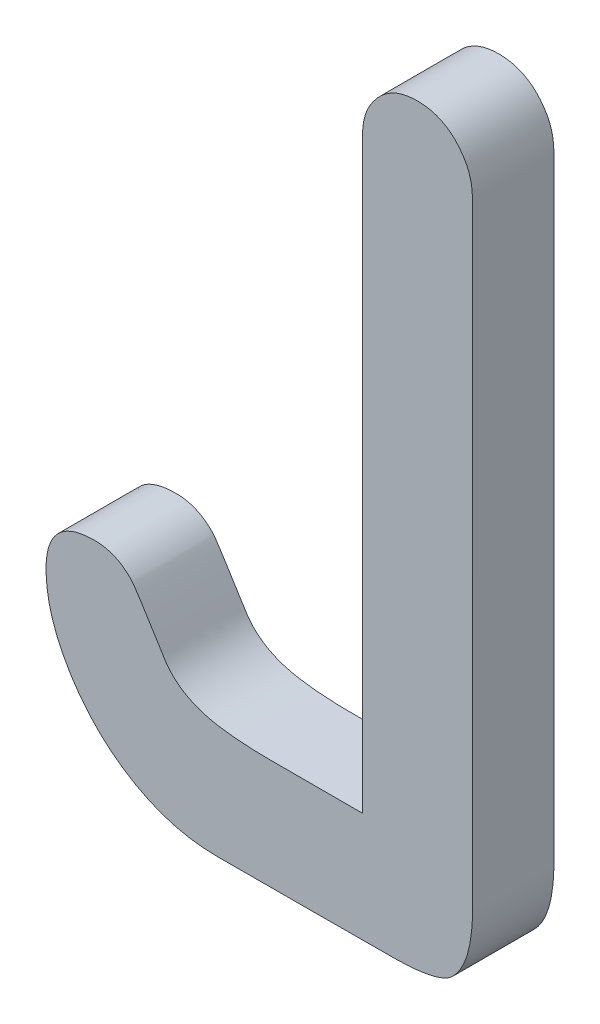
ISO-10303-21;
HEADER;
FILE_DESCRIPTION(('STEP AP214'),'2;1');
FILE_NAME('part.step','',(''),(''),'','','');
FILE_SCHEMA(('AUTOMOTIVE_DESIGN { 1 0 10303 214 1 1 1 1 }'));
ENDSEC;
DATA;
#1=APPLICATION_CONTEXT('core data for automotive mechanical design processes');
#2=APPLICATION_PROTOCOL_DEFINITION('international standard','automotive_design',2000,#1);
#3=PRODUCT_CONTEXT('',#1,'mechanical');
#4=PRODUCT('Part','Part','',(#3));
#5=PRODUCT_RELATED_PRODUCT_CATEGORY('part','',(#4));
#6=PRODUCT_DEFINITION_FORMATION('','',#4);
#7=PRODUCT_DEFINITION_CONTEXT('part definition',#1,'design');
#8=PRODUCT_DEFINITION('design','',#6,#7);
#9=PRODUCT_DEFINITION_SHAPE('','',#8);
#10=(LENGTH_UNIT() NAMED_UNIT(*) SI_UNIT(.MILLI.,.METRE.));
#11=(NAMED_UNIT(*) PLANE_ANGLE_UNIT() SI_UNIT($,.RADIAN.));
#12=(NAMED_UNIT(*) SI_UNIT($,.STERADIAN.) SOLID_ANGLE_UNIT());
#13=UNCERTAINTY_MEASURE_WITH_UNIT(LENGTH_MEASURE(1.E-05),#10,'distance_accuracy_value','');
#14=(GEOMETRIC_REPRESENTATION_CONTEXT(3) GLOBAL_UNCERTAINTY_ASSIGNED_CONTEXT((#13)) GLOBAL_UNIT_ASSIGNED_CONTEXT((#10,
#11,#12)) REPRESENTATION_CONTEXT('',''));
#15=CARTESIAN_POINT('',(0.,0.,0.));
#16=DIRECTION('',(0.,0.,1.));
#17=DIRECTION('',(1.,0.,0.));
#18=AXIS2_PLACEMENT_3D('',#15,#16,#17);
#19=CARTESIAN_POINT('',(32.8734988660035,-0.0550507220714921,0.500000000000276));
#20=CARTESIAN_POINT('',(32.8734988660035,1.74256832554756,0.500000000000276));
#21=CARTESIAN_POINT('',(32.8734988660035,3.54018737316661,0.500000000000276));
#22=CARTESIAN_POINT('',(32.8734988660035,3.65447308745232,0.500000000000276));
#23=CARTESIAN_POINT('',(32.9194963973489,3.73163023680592,0.500000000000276));
#24=CARTESIAN_POINT('',(33.0211179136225,3.90209213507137,0.500000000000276));
#25=CARTESIAN_POINT('',(33.2115941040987,3.90209213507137,0.500000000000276));
#26=CARTESIAN_POINT('',(33.4020702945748,3.90209213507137,0.500000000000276));
#27=CARTESIAN_POINT('',(33.5036918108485,3.73163023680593,0.500000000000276));
#28=CARTESIAN_POINT('',(33.549689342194,3.65447308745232,0.500000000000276));
#29=CARTESIAN_POINT('',(33.5496893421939,3.5401873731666,0.500000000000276));
#30=CARTESIAN_POINT('',(33.5496893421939,1.65685403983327,0.500000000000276));
#31=CARTESIAN_POINT('',(33.549689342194,-0.226479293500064,0.500000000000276));
#32=CARTESIAN_POINT('',(33.5496893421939,-0.526479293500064,0.500000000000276));
#33=CARTESIAN_POINT('',(33.4268208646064,-0.646490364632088,0.500000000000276));
#34=CARTESIAN_POINT('',(33.344927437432,-0.726479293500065,0.500000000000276));
#35=CARTESIAN_POINT('',(33.063956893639,-0.728108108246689,0.500000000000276));
#36=CARTESIAN_POINT('',(32.5234988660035,-0.73124119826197,0.500000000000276));
#37=CARTESIAN_POINT('',(31.9830226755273,-0.731241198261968,0.500000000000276));
#38=B_SPLINE_CURVE_WITH_KNOTS('',2,(#19,#20,#21,#22,#23,#24,#25,#26,#27,#28,#29,#30,#31,#32,#33,
#34,#35,#36,#37),.UNSPECIFIED.,.F.,.F.,(3,2,2,2,2,2,2,2,2,3),(0.,1.,2.,3.,4.,5.,6.,7.,8.,9.),.UNSPECIFIED.);
#39=DIRECTION('',(0.,0.,-1.));
#40=VECTOR('',#39,1.);
#41=SURFACE_OF_LINEAR_EXTRUSION('',#38,#40);
#42=CARTESIAN_POINT('',(32.8734988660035,-0.0550507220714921,2.75798949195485E-13));
#43=CARTESIAN_POINT('',(32.8734988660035,1.74256832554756,2.75798949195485E-13));
#44=CARTESIAN_POINT('',(32.8734988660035,3.54018737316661,2.75798949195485E-13));
#45=CARTESIAN_POINT('',(32.8734988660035,3.65447308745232,2.75798949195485E-13));
#46=CARTESIAN_POINT('',(32.9194963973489,3.73163023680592,2.758045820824E-13));
#47=CARTESIAN_POINT('',(33.0211179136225,3.90209213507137,2.75817026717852E-13));
#48=CARTESIAN_POINT('',(33.2115941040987,3.90209213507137,2.75840352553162E-13));
#49=CARTESIAN_POINT('',(33.4020702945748,3.90209213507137,2.75863678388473E-13));
#50=CARTESIAN_POINT('',(33.5036918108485,3.73163023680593,2.75876123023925E-13));
#51=CARTESIAN_POINT('',(33.549689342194,3.65447308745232,2.75881755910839E-13));
#52=CARTESIAN_POINT('',(33.5496893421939,3.5401873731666,2.75881755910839E-13));
#53=CARTESIAN_POINT('',(33.5496893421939,1.65685403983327,2.75881755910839E-13));
#54=CARTESIAN_POINT('',(33.549689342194,-0.226479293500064,2.75881755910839E-13));
#55=CARTESIAN_POINT('',(33.5496893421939,-0.526479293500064,2.75881755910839E-13));
#56=CARTESIAN_POINT('',(33.4268208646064,-0.646490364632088,2.75866709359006E-13));
#57=CARTESIAN_POINT('',(33.344927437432,-0.726479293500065,2.7585668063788E-13));
#58=CARTESIAN_POINT('',(33.063956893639,-0.728108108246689,2.75822272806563E-13));
#59=CARTESIAN_POINT('',(32.5234988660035,-0.73124119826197,2.75756087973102E-13));
#60=CARTESIAN_POINT('',(31.9830226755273,-0.731241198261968,2.75689900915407E-13));
#61=B_SPLINE_CURVE_WITH_KNOTS('',2,(#42,#43,#44,#45,#46,#47,#48,#49,#50,#51,#52,#53,#54,#55,#56,
#57,#58,#59,#60),.UNSPECIFIED.,.F.,.F.,(3,2,2,2,2,2,2,2,2,3),(0.,1.,2.,3.,4.,5.,6.,7.,8.,9.),.UNSPECIFIED.);
#62=CARTESIAN_POINT('',(32.8734988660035,-0.0550507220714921,2.75798949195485E-13));
#63=VERTEX_POINT('',#62);
#64=CARTESIAN_POINT('',(31.9830226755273,-0.731241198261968,2.75689900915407E-13));
#65=VERTEX_POINT('',#64);
#66=EDGE_CURVE('E42',#63,#65,#61,.T.);
#67=ORIENTED_EDGE('',*,*,#66,.F.);
#68=DIRECTION('',(0.,0.,-1.));
#69=VECTOR('',#68,1.);
#70=CARTESIAN_POINT('',(32.8734988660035,-0.0550507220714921,0.500000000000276));
#71=LINE('',#70,#69);
#72=CARTESIAN_POINT('',(32.8734988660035,-0.0550507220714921,0.500000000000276));
#73=VERTEX_POINT('',#72);
#74=EDGE_CURVE('E25',#73,#63,#71,.T.);
#75=ORIENTED_EDGE('',*,*,#74,.F.);
#76=CARTESIAN_POINT('',(31.9830226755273,-0.731241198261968,0.500000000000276));
#77=VERTEX_POINT('',#76);
#78=EDGE_CURVE('E44',#73,#77,#38,.T.);
#79=ORIENTED_EDGE('',*,*,#78,.T.);
#80=DIRECTION('',(0.,0.,-1.));
#81=VECTOR('',#80,1.);
#82=CARTESIAN_POINT('',(31.9830226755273,-0.731241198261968,0.500000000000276));
#83=LINE('',#82,#81);
#84=EDGE_CURVE('E11',#77,#65,#83,.T.);
#85=ORIENTED_EDGE('',*,*,#84,.T.);
#86=EDGE_LOOP('',(#67,#75,#79,#85));
#87=FACE_BOUND('',#86,.T.);
#88=ADVANCED_FACE('F16',(#87),#41,.T.);
#89=CARTESIAN_POINT('',(31.9830226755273,-0.731241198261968,0.500000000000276));
#90=CARTESIAN_POINT('',(31.6877845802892,-0.73124119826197,0.500000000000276));
#91=CARTESIAN_POINT('',(31.4396501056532,-0.57491647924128,0.500000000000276));
#92=CARTESIAN_POINT('',(31.2115941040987,-0.431241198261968,0.500000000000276));
#93=CARTESIAN_POINT('',(31.0711179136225,-0.195526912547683,0.500000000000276));
#94=CARTESIAN_POINT('',(30.9306417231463,0.0401873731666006,0.500000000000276));
#95=CARTESIAN_POINT('',(30.9306417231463,0.273520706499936,0.500000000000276));
#96=CARTESIAN_POINT('',(30.9306417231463,0.573520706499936,0.500000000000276));
#97=CARTESIAN_POINT('',(31.2306417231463,0.573520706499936,0.500000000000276));
#98=CARTESIAN_POINT('',(31.3639750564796,0.573520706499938,0.500000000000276));
#99=CARTESIAN_POINT('',(31.455590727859,0.474575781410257,0.500000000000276));
#100=CARTESIAN_POINT('',(31.4830226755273,0.444949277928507,0.500000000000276));
#101=CARTESIAN_POINT('',(31.6541491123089,0.163812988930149,0.500000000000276));
#102=CARTESIAN_POINT('',(31.7496893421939,0.00685403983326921,0.500000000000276));
#103=CARTESIAN_POINT('',(31.9875271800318,-0.0327855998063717,0.500000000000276));
#104=CARTESIAN_POINT('',(32.1211179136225,-0.0550507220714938,0.500000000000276));
#105=CARTESIAN_POINT('',(32.3115941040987,-0.0550507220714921,0.500000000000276));
#106=CARTESIAN_POINT('',(32.592546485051,-0.0550507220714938,0.500000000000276));
#107=CARTESIAN_POINT('',(32.8734988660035,-0.0550507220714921,0.500000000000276));
#108=B_SPLINE_CURVE_WITH_KNOTS('',2,(#89,#90,#91,#92,#93,#94,#95,#96,#97,#98,#99,#100,#101,#102,
#103,#104,#105,#106,#107),.UNSPECIFIED.,.F.,.F.,(3,2,2,2,2,2,2,2,2,3),(9.,10.,11.,12.,13.,14.,
15.,16.,17.,18.),.UNSPECIFIED.);
#109=DIRECTION('',(0.,0.,-1.));
#110=VECTOR('',#109,1.);
#111=SURFACE_OF_LINEAR_EXTRUSION('',#108,#110);
#112=CARTESIAN_POINT('',(31.9830226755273,-0.731241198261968,2.75689900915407E-13));
#113=CARTESIAN_POINT('',(31.6877845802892,-0.73124119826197,2.75653745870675E-13));
#114=CARTESIAN_POINT('',(31.4396501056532,-0.57491647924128,2.75623359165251E-13));
#115=CARTESIAN_POINT('',(31.2115941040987,-0.431241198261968,2.75595431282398E-13));
#116=CARTESIAN_POINT('',(31.0711179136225,-0.195526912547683,2.75578228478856E-13));
#117=CARTESIAN_POINT('',(30.9306417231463,0.0401873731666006,2.75561025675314E-13));
#118=CARTESIAN_POINT('',(30.9306417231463,0.273520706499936,2.75561025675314E-13));
#119=CARTESIAN_POINT('',(30.9306417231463,0.573520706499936,2.75561025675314E-13));
#120=CARTESIAN_POINT('',(31.2306417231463,0.573520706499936,2.75597763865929E-13));
#121=CARTESIAN_POINT('',(31.3639750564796,0.573520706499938,2.75614091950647E-13));
#122=CARTESIAN_POINT('',(31.455590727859,0.474575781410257,2.75625311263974E-13));
#123=CARTESIAN_POINT('',(31.4830226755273,0.444949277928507,2.75628670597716E-13));
#124=CARTESIAN_POINT('',(31.6541491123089,0.163812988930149,2.75649626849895E-13));
#125=CARTESIAN_POINT('',(31.7496893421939,0.00685403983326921,2.75661326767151E-13));
#126=CARTESIAN_POINT('',(31.9875271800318,-0.0327855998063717,2.75690452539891E-13));
#127=CARTESIAN_POINT('',(32.1211179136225,-0.0550507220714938,2.75706812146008E-13));
#128=CARTESIAN_POINT('',(32.3115941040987,-0.0550507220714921,2.75730137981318E-13));
#129=CARTESIAN_POINT('',(32.592546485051,-0.0550507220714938,2.75764543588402E-13));
#130=CARTESIAN_POINT('',(32.8734988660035,-0.0550507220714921,2.75798949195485E-13));
#131=B_SPLINE_CURVE_WITH_KNOTS('',2,(#112,#113,#114,#115,#116,#117,#118,#119,#120,#121,#122,
#123,#124,#125,#126,#127,#128,#129,#130),.UNSPECIFIED.,.F.,.F.,(3,2,2,2,2,2,2,2,2,3),(9.,10.,
11.,12.,13.,14.,15.,16.,17.,18.),.UNSPECIFIED.);
#132=EDGE_CURVE('E46',#65,#63,#131,.T.);
#133=ORIENTED_EDGE('',*,*,#132,.F.);
#134=ORIENTED_EDGE('',*,*,#84,.F.);
#135=EDGE_CURVE('E77',#77,#73,#108,.T.);
#136=ORIENTED_EDGE('',*,*,#135,.T.);
#137=ORIENTED_EDGE('',*,*,#74,.T.);
#138=EDGE_LOOP('',(#133,#134,#136,#137));
#139=FACE_BOUND('',#138,.T.);
#140=ADVANCED_FACE('F47',(#139),#111,.T.);
#141=CARTESIAN_POINT('',(33.5381899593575,3.64519094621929,0.500000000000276));
#142=DIRECTION('',(0.,0.,1.));
#143=DIRECTION('',(0.948007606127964,-0.318247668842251,0.));
#144=AXIS2_PLACEMENT_3D('',#141,#142,#143);
#145=PLANE('',#144);
#146=ORIENTED_EDGE('',*,*,#78,.F.);
#147=ORIENTED_EDGE('',*,*,#135,.F.);
#148=EDGE_LOOP('',(#146,#147));
#149=FACE_BOUND('',#148,.T.);
#150=ADVANCED_FACE('F90',(#149),#145,.T.);
#151=CARTESIAN_POINT('',(33.5381899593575,3.64519094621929,2.7588034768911E-13));
#152=DIRECTION('',(0.,0.,1.));
#153=DIRECTION('',(0.948007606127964,-0.318247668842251,0.));
#154=AXIS2_PLACEMENT_3D('',#151,#152,#153);
#155=PLANE('',#154);
#156=ORIENTED_EDGE('',*,*,#66,.T.);
#157=ORIENTED_EDGE('',*,*,#132,.T.);
#158=EDGE_LOOP('',(#156,#157));
#159=FACE_BOUND('',#158,.T.);
#160=ADVANCED_FACE('F51',(#159),#155,.F.);
#161=CLOSED_SHELL('',(#88,#140,#150,#160));
#162=MANIFOLD_SOLID_BREP('B1',#161);
#163=ADVANCED_BREP_SHAPE_REPRESENTATION('',(#18,#162),#14);
#164=SHAPE_DEFINITION_REPRESENTATION(#9,#163);
ENDSEC;
END-ISO-10303-21;
